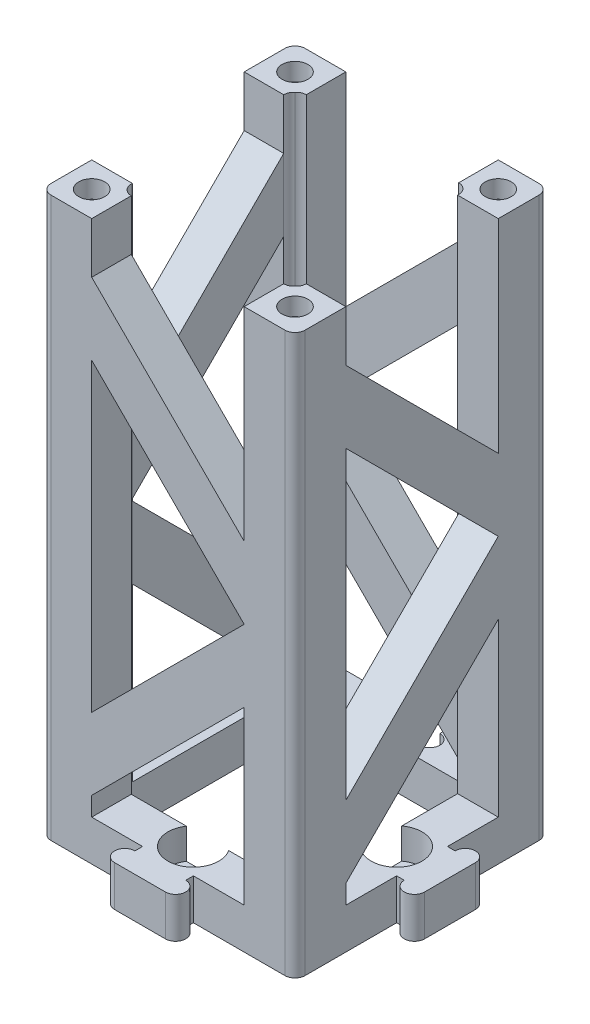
from build123d import *

# Parameters (mm, degrees)
SKETCH2_R            = 2.55
BOSS_EXTRUDE2_DEPTH  = 8
SKETCH3_R            = 5
CUT_EXTRUDE1_DEPTH   = 6
SKETCH5_R            = 3
BOSS_EXTRUDE3_DEPTH  = 4.5
SKETCH6_R            = 2.55
BOSS_EXTRUDE4_DEPTH  = 102
SKETCH7_R            = 2.55
BOSS_EXTRUDE5_DEPTH  = 98.5
BOSS_EXTRUDE8_START  = -7.782086
BOSS_EXTRUDE8_DEPTH  = 7.782086
BOSS_EXTRUDE9_DEPTH  = 7.782086
BOSS_EXTRUDE10_DEPTH = 7.78209
BOSS_EXTRUDE11_DEPTH = 7.782086


with BuildPart() as part:
    # Sketch2 → Boss-Extrude2 (new body)
    # profile 1 of 3: a face of its own
    with BuildSketch(Plane(origin=(0, 0, 0), x_dir=(1, 0, 0), z_dir=(0, 1, 0))):
        with BuildLine():
            Line((-25, 5), (-23.5, 5))
            ThreePointArc((-23.5, 5), (-21.5, 7), (-19.5, 5))
            Line((-19.5, 5), (-19.5, -5))
            ThreePointArc((-19.5, -5), (-21.5, -7), (-23.5, -5))
            Line((-23.5, -5), (-25, -5))
            Line((-25, -5), (-25, -23))
            ThreePointArc((-25, -23), (-24.414213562, -24.414213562), (-23, -25))
            Line((-23, -25), (23, -25))
            ThreePointArc((23, -25), (24.414213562, -24.414213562), (25, -23))
            Line((25, -23), (25, 23))
            ThreePointArc((25, 23), (24.414213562, 24.414213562), (23, 25))
            Line((23, 25), (5, 25))
            Line((5, 25), (5, 23.5))
            ThreePointArc((5, 23.5), (7, 21.5), (5, 19.5))
            Line((5, 19.5), (-5, 19.5))
            ThreePointArc((-5, 19.5), (-7, 21.5), (-5, 23.5))
            Line((-5, 23.5), (-5, 25))
            Line((-5, 25), (-23, 25))
            ThreePointArc((-23, 25), (-24.414213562, 24.414213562), (-25, 23))
            Line((-25, 23), (-25, 5))
        make_face()
        with Locations(Location((20, -20, 0), (0, 0, 270))):
            Circle(SKETCH2_R, mode=Mode.SUBTRACT)
        with Locations(Location((20, 20, 0), (0, 0, 270))):
            Circle(SKETCH2_R, mode=Mode.SUBTRACT)
        with Locations(Location((-20, 20, 0), (0, 0, 270))):
            Circle(SKETCH2_R, mode=Mode.SUBTRACT)
        with Locations(Location((-20, -20, 0), (0, 0, 270))):
            Circle(SKETCH2_R, mode=Mode.SUBTRACT)
        with BuildLine():
            ThreePointArc((17, -1.25), (23.25, 0), (17, 1.25))
            Line((17, 1.25), (17, 15.217914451))
            ThreePointArc((17, 15.217914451), (16.414213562, 16.632128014), (15, 17.217914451))
            Line((15, 17.217914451), (-15, 17.217914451))
            ThreePointArc((-15, 17.217914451), (-16.414213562, 16.632128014), (-17, 15.217914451))
            Line((-17, 15.217914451), (-17, -15.217914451))
            ThreePointArc((-17, -15.217914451), (-16.414213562, -16.632128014), (-15, -17.217914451))
            Line((-15, -17.217914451), (-1.25, -17.217914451))
            ThreePointArc((-1.25, -17.217914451), (0, -23.05), (1.25, -17.217914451))
            Line((1.25, -17.217914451), (15, -17.217914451))
            ThreePointArc((15, -17.217914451), (16.414213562, -16.632128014), (17, -15.217914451))
            Line((17, -15.217914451), (17, -1.25))
        make_face(mode=Mode.SUBTRACT)
    # profile 2 of 3: a face of its own
    with BuildSketch(Plane(origin=(0, 0, 0), x_dir=(1, 0, 0), z_dir=(0, 1, 0))):
        with BuildLine():
            Line((5, -26.5), (5, -25))
            Line((5, -25), (-5, -25))
            Line((-5, -25), (-5, -26.5))
            ThreePointArc((-5, -26.5), (-7, -28.5), (-5, -30.5))
            Line((-5, -30.5), (5, -30.5))
            ThreePointArc((5, -30.5), (7, -28.5), (5, -26.5))
        make_face()
    # profile 3 of 3: a face of its own
    with BuildSketch(Plane(origin=(0, 0, 0), x_dir=(1, 0, 0), z_dir=(0, 1, 0))):
        with BuildLine():
            Line((25, 5), (25, -5))
            Line((25, -5), (26.5, -5))
            ThreePointArc((26.5, -5), (28.5, -7), (30.5, -5))
            Line((30.5, -5), (30.5, 5))
            ThreePointArc((30.5, 5), (28.5, 7), (26.5, 5))
            Line((26.5, 5), (25, 5))
        make_face()
    extrude(amount=BOSS_EXTRUDE2_DEPTH)

    # Sketch3 → Cut-Extrude1 (cut)
    with BuildSketch(Plane(origin=(0, 8, 0), x_dir=(1, 0, 0), z_dir=(0, 1, 0))):
        with Locations((0, -20)):
            Circle(SKETCH3_R)
        with Locations((20, 0)):
            Circle(SKETCH3_R)
    extrude(amount=-CUT_EXTRUDE1_DEPTH, mode=Mode.SUBTRACT)

    # Sketch5 → Boss-Extrude3 (add)
    with BuildSketch(Plane.XZ):
        with Locations((-20, 20)):
            Circle(SKETCH5_R)
        with Locations((20, 20)):
            Circle(SKETCH5_R)
        with Locations((20, -20)):
            Circle(SKETCH5_R)
        with Locations((-20, -20)):
            Circle(SKETCH5_R)
    extrude(amount=-BOSS_EXTRUDE3_DEPTH)

    # Sketch6 → Boss-Extrude4 (add)
    # profile 1 of 4: a face of its own
    with BuildSketch(Plane(origin=(0, 8, 0), x_dir=(1, 0, 0), z_dir=(0, 1, 0))):
        with BuildLine():
            Line((-17, -15.217914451), (-17, -15))
            Line((-17, -15), (-25, -15))
            Line((-25, -15), (-25, -23))
            ThreePointArc((-25, -23), (-24.414213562, -24.414213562), (-23, -25))
            Line((-23, -25), (-15, -25))
            Line((-15, -25), (-15, -17.217914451))
            ThreePointArc((-15, -17.217914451), (-16.414213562, -16.632128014), (-17, -15.217914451))
        make_face()
        with Locations(Location((-20, -20, 0), (0, 0, 90))):
            Circle(SKETCH6_R, mode=Mode.SUBTRACT)
    # profile 2 of 4: a face of its own
    with BuildSketch(Plane(origin=(0, 8, 0), x_dir=(1, 0, 0), z_dir=(0, 1, 0))):
        with BuildLine():
            ThreePointArc((17.217914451, -15), (17.034794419, -15.836030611), (16.518967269, -16.518967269))
            ThreePointArc((16.518967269, -16.518967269), (15.836030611, -17.034794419), (15, -17.217914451))
            Line((15, -17.217914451), (15, -25))
            Line((15, -25), (23, -25))
            ThreePointArc((23, -25), (24.414213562, -24.414213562), (25, -23))
            Line((25, -23), (25, -15))
            Line((25, -15), (17.217914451, -15))
        make_face()
        with Locations(Location((20, -20, 0), (0, 0, 90))):
            Circle(SKETCH6_R, mode=Mode.SUBTRACT)
    # profile 3 of 4: a face of its own
    with BuildSketch(Plane(origin=(0, 8, 0), x_dir=(1, 0, 0), z_dir=(0, 1, 0))):
        with BuildLine():
            ThreePointArc((15, 17.217914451), (16.414213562, 16.632128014), (17, 15.217914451))
            Line((17, 15.217914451), (17, 15))
            Line((17, 15), (25, 15))
            Line((25, 15), (25, 23))
            ThreePointArc((25, 23), (24.414213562, 24.414213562), (23, 25))
            Line((23, 25), (15, 25))
            Line((15, 25), (15, 17.217914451))
        make_face()
        with Locations(Location((20, 20, 0), (0, 0, 90))):
            Circle(SKETCH6_R, mode=Mode.SUBTRACT)
    # profile 4 of 4: a face of its own
    with BuildSketch(Plane(origin=(0, 8, 0), x_dir=(1, 0, 0), z_dir=(0, 1, 0))):
        with BuildLine():
            ThreePointArc((-17.217914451, 15), (-17.034794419, 15.836030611), (-16.518967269, 16.518967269))
            ThreePointArc((-16.518967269, 16.518967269), (-15.836030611, 17.034794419), (-15, 17.217914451))
            Line((-15, 17.217914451), (-15, 25))
            Line((-15, 25), (-23, 25))
            ThreePointArc((-23, 25), (-24.414213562, 24.414213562), (-25, 23))
            Line((-25, 23), (-25, 15))
            Line((-25, 15), (-17.217914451, 15))
        make_face()
        with Locations(Location((-20, 20, 0), (0, 0, 90))):
            Circle(SKETCH6_R, mode=Mode.SUBTRACT)
    extrude(amount=BOSS_EXTRUDE4_DEPTH)

    # Sketch7 → Boss-Extrude5 (add)
    with BuildSketch(Plane(origin=(0, 8, 0), x_dir=(1, 0, 0), z_dir=(0, 1, 0))):
        with Locations(Location((-20, 20, 0), (0, 0, 270))):
            Circle(SKETCH7_R)
        with Locations(Location((-20, -20, 0), (0, 0, 270))):
            Circle(SKETCH7_R)
        with Locations(Location((20, -20, 0), (0, 0, 270))):
            Circle(SKETCH7_R)
        with Locations(Location((20, 20, 0), (0, 0, 270))):
            Circle(SKETCH7_R)
    extrude(amount=BOSS_EXTRUDE5_DEPTH)

    # Sketch8 → Boss-Extrude8 (add)
    with BuildSketch(Plane(origin=(25, 0, 0), x_dir=(0, 0, -1), z_dir=(1, 0, 0)).offset(BOSS_EXTRUDE8_START)):
        Polygon((-15, 25.857864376), (-15, 11.715728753), (15, 41.715728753), (15, 55.857864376), align=None)
        Polygon((-15, 85.857864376), (15, 55.857864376), (15, 70), (-15, 100), align=None)
    extrude(amount=BOSS_EXTRUDE8_DEPTH)

    # Sketch12 → Boss-Extrude9 (add)
    with BuildSketch(Plane(origin=(0, 0, -25), x_dir=(-1, 0, 0), z_dir=(0, 0, -1))):
        Polygon((-15, 25.857864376), (-15, 11.715728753), (15, 41.715728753), (15, 55.857864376), align=None)
        Polygon((15, 55.857864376), (-15, 85.857864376), (-15, 100), (15, 70), align=None)
    extrude(amount=-BOSS_EXTRUDE9_DEPTH)

    # Sketch13 → Boss-Extrude10 (add)
    with BuildSketch(Plane.ZY.offset(25)):
        Polygon((-15, 85.857864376), (15, 55.857864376), (15, 70), (-15, 100), align=None)
        Polygon((-15, 25.857864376), (-15, 11.715728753), (15, 41.715728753), (15, 55.857864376), align=None)
    extrude(amount=-BOSS_EXTRUDE10_DEPTH)

    # Sketch14 → Boss-Extrude11 (add)
    with BuildSketch(Plane.XY.offset(25)):
        Polygon((-15, 85.857864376), (15, 55.857864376), (15, 70), (-15, 100), align=None)
        Polygon((-15, 25.857864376), (-15, 11.715728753), (15, 41.715728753), (15, 55.857864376), align=None)
    extrude(amount=-BOSS_EXTRUDE11_DEPTH)


solid = part.part
